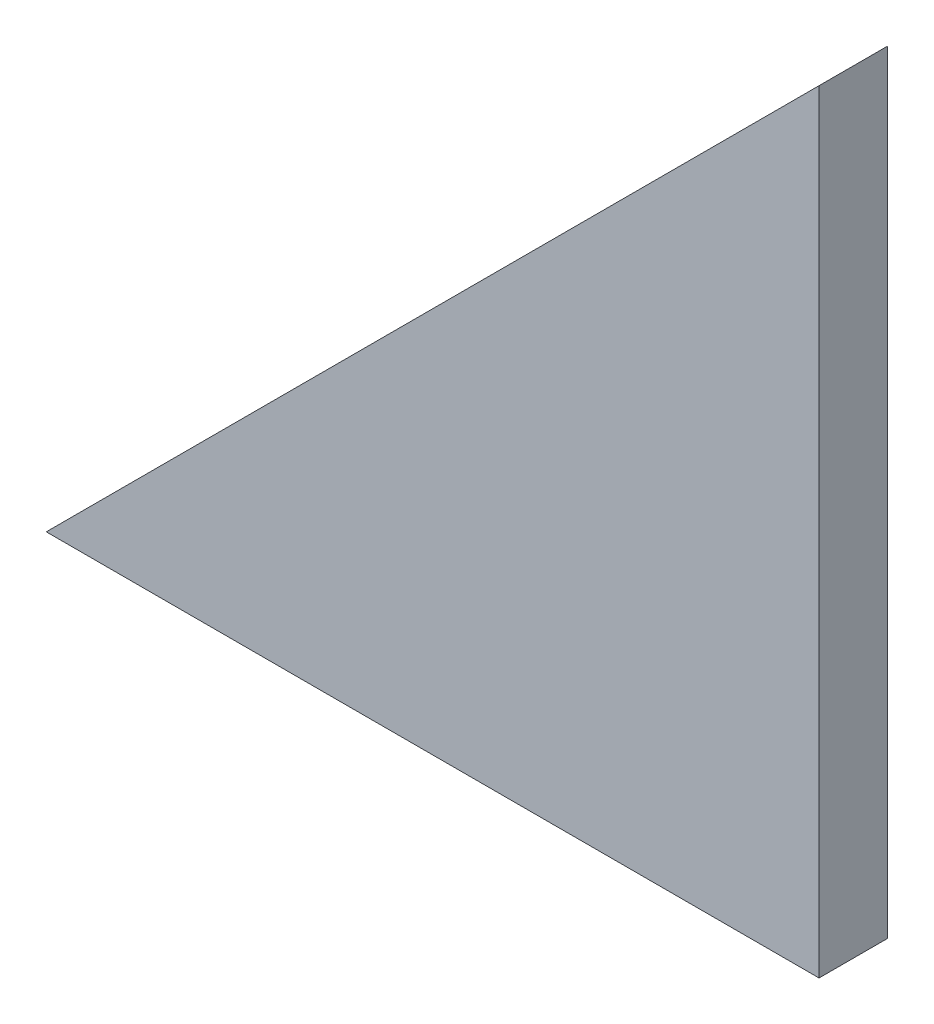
from build123d import *

# Parameters (mm, degrees)
DODANIE_WYCI_GNI_CIE1_DEPTH    = 8
OTW_R_GWINTOWANY_M5X0_81_D     = 4.2
OTW_R_GWINTOWANY_M5X0_81_DEPTH = 14
OTW_R_GWINTOWANY_M5X0_81_TIP   = 1.2618073
OTW_R_GWINTOWANY_M5X0_82_D     = 4.2
OTW_R_GWINTOWANY_M5X0_82_DEPTH = 14
OTW_R_GWINTOWANY_M5X0_82_TIP   = 1.2618073


with BuildPart() as part:
    # Szkic1 → Dodanie-wyci_gni_cie1 (new body)
    with BuildSketch(Plane.XY):
        Polygon((0, 0), (90, 0), (90, 90), align=None)
    extrude(amount=DODANIE_WYCI_GNI_CIE1_DEPTH)

    # Otw_r gwintowany M5x0.81
    with Locations(Plane(origin=(0, 0, 0), x_dir=(0, 0, 1), z_dir=(-0.7071067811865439, 0.7071067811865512, 0))):
        with Locations((4, 35), (4, 110)):
            Hole(OTW_R_GWINTOWANY_M5X0_81_D / 2, depth=OTW_R_GWINTOWANY_M5X0_81_DEPTH)
            with Locations((0, 0, -(OTW_R_GWINTOWANY_M5X0_81_DEPTH + OTW_R_GWINTOWANY_M5X0_81_TIP / 2))):  # 118° drill point
                Cone(0, OTW_R_GWINTOWANY_M5X0_81_D / 2, OTW_R_GWINTOWANY_M5X0_81_TIP, mode=Mode.SUBTRACT)

    # Otw_r gwintowany M5x0.82
    with Locations(Plane(origin=(0, 0, 0), x_dir=(-1, 0, 0), z_dir=(0, -1, 0))):
        with Locations((-25.5, -4), (-55.5, -4)):
            Hole(OTW_R_GWINTOWANY_M5X0_82_D / 2, depth=OTW_R_GWINTOWANY_M5X0_82_DEPTH)
            with Locations((0, 0, -(OTW_R_GWINTOWANY_M5X0_82_DEPTH + OTW_R_GWINTOWANY_M5X0_82_TIP / 2))):  # 118° drill point
                Cone(0, OTW_R_GWINTOWANY_M5X0_82_D / 2, OTW_R_GWINTOWANY_M5X0_82_TIP, mode=Mode.SUBTRACT)


solid = part.part
